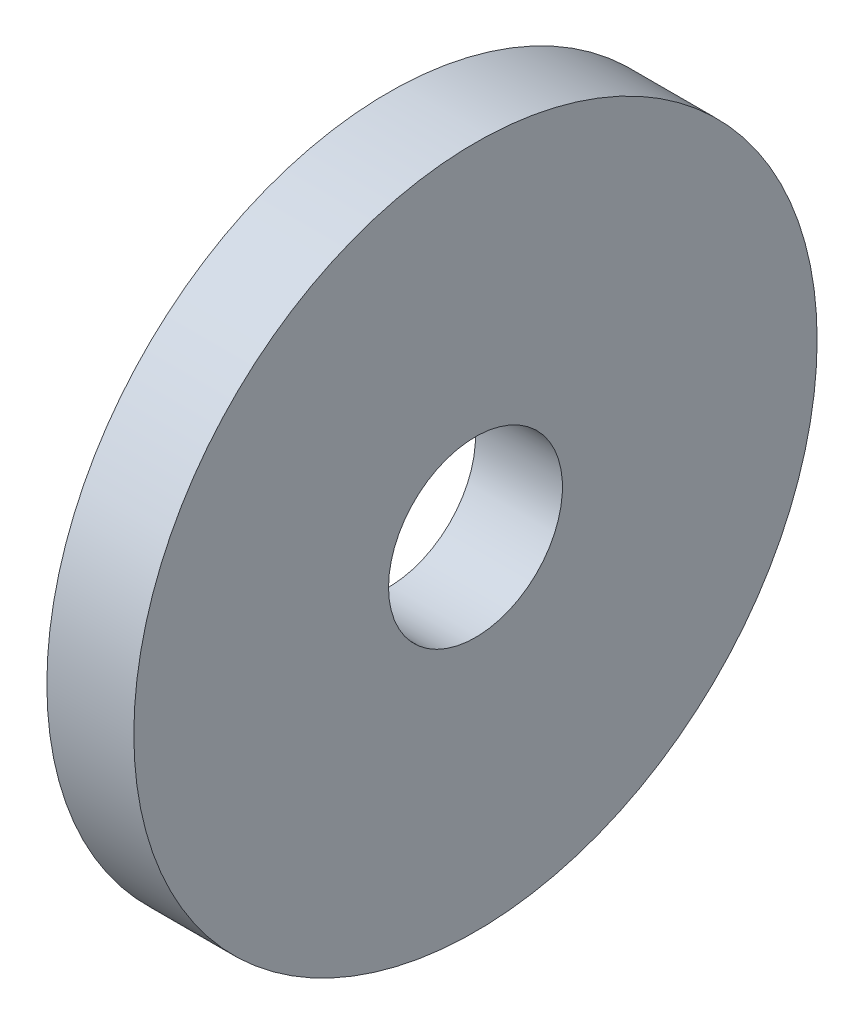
ISO-10303-21;
HEADER;
FILE_DESCRIPTION(('STEP AP214'),'2;1');
FILE_NAME('part.step','',(''),(''),'','','');
FILE_SCHEMA(('AUTOMOTIVE_DESIGN { 1 0 10303 214 1 1 1 1 }'));
ENDSEC;
DATA;
#1=APPLICATION_CONTEXT('core data for automotive mechanical design processes');
#2=APPLICATION_PROTOCOL_DEFINITION('international standard','automotive_design',2000,#1);
#3=PRODUCT_CONTEXT('',#1,'mechanical');
#4=PRODUCT('Part','Part','',(#3));
#5=PRODUCT_RELATED_PRODUCT_CATEGORY('part','',(#4));
#6=PRODUCT_DEFINITION_FORMATION('','',#4);
#7=PRODUCT_DEFINITION_CONTEXT('part definition',#1,'design');
#8=PRODUCT_DEFINITION('design','',#6,#7);
#9=PRODUCT_DEFINITION_SHAPE('','',#8);
#10=(LENGTH_UNIT() NAMED_UNIT(*) SI_UNIT(.MILLI.,.METRE.));
#11=(NAMED_UNIT(*) PLANE_ANGLE_UNIT() SI_UNIT($,.RADIAN.));
#12=(NAMED_UNIT(*) SI_UNIT($,.STERADIAN.) SOLID_ANGLE_UNIT());
#13=UNCERTAINTY_MEASURE_WITH_UNIT(LENGTH_MEASURE(1.E-05),#10,'distance_accuracy_value','');
#14=(GEOMETRIC_REPRESENTATION_CONTEXT(3) GLOBAL_UNCERTAINTY_ASSIGNED_CONTEXT((#13)) GLOBAL_UNIT_ASSIGNED_CONTEXT((#10,
#11,#12)) REPRESENTATION_CONTEXT('',''));
#15=CARTESIAN_POINT('',(0.,0.,0.));
#16=DIRECTION('',(0.,0.,1.));
#17=DIRECTION('',(1.,0.,0.));
#18=AXIS2_PLACEMENT_3D('',#15,#16,#17);
#19=CARTESIAN_POINT('',(0.,0.,-27.5));
#20=DIRECTION('',(1.,0.,0.));
#21=DIRECTION('',(0.,0.,-1.));
#22=AXIS2_PLACEMENT_3D('',#19,#20,#21);
#23=PLANE('',#22);
#24=CARTESIAN_POINT('',(0.,0.,0.));
#25=DIRECTION('',(-1.,0.,0.));
#26=DIRECTION('',(0.,0.,1.));
#27=AXIS2_PLACEMENT_3D('',#24,#25,#26);
#28=CIRCLE('',#27,7.);
#29=CARTESIAN_POINT('',(0.,0.,7.));
#30=VERTEX_POINT('',#29);
#31=EDGE_CURVE('E10',#30,#30,#28,.T.);
#32=ORIENTED_EDGE('',*,*,#31,.F.);
#33=EDGE_LOOP('',(#32));
#34=FACE_BOUND('',#33,.T.);
#35=CARTESIAN_POINT('',(0.,0.,0.));
#36=DIRECTION('',(-1.,0.,0.));
#37=DIRECTION('',(0.,0.,1.));
#38=AXIS2_PLACEMENT_3D('',#35,#36,#37);
#39=CIRCLE('',#38,27.5);
#40=CARTESIAN_POINT('',(0.,0.,27.5));
#41=VERTEX_POINT('',#40);
#42=EDGE_CURVE('E46',#41,#41,#39,.T.);
#43=ORIENTED_EDGE('',*,*,#42,.T.);
#44=EDGE_LOOP('',(#43));
#45=FACE_BOUND('',#44,.T.);
#46=ADVANCED_FACE('F32',(#34,#45),#23,.F.);
#47=CARTESIAN_POINT('',(0.,0.,0.));
#48=DIRECTION('',(-1.,0.,0.));
#49=DIRECTION('',(0.,0.,1.));
#50=AXIS2_PLACEMENT_3D('',#47,#48,#49);
#51=CYLINDRICAL_SURFACE('',#50,7.);
#52=CARTESIAN_POINT('',(7.,0.,0.));
#53=DIRECTION('',(-1.,0.,0.));
#54=DIRECTION('',(0.,0.,1.));
#55=AXIS2_PLACEMENT_3D('',#52,#53,#54);
#56=CIRCLE('',#55,7.);
#57=CARTESIAN_POINT('',(7.,0.,7.));
#58=VERTEX_POINT('',#57);
#59=EDGE_CURVE('E38',#58,#58,#56,.T.);
#60=ORIENTED_EDGE('',*,*,#59,.F.);
#61=EDGE_LOOP('',(#60));
#62=FACE_BOUND('',#61,.T.);
#63=ORIENTED_EDGE('',*,*,#31,.T.);
#64=EDGE_LOOP('',(#63));
#65=FACE_BOUND('',#64,.T.);
#66=ADVANCED_FACE('F61',(#62,#65),#51,.F.);
#67=CARTESIAN_POINT('',(7.,0.,-27.5));
#68=DIRECTION('',(-1.,0.,0.));
#69=DIRECTION('',(0.,0.,1.));
#70=AXIS2_PLACEMENT_3D('',#67,#68,#69);
#71=PLANE('',#70);
#72=CARTESIAN_POINT('',(7.,0.,0.));
#73=DIRECTION('',(-1.,0.,0.));
#74=DIRECTION('',(0.,0.,1.));
#75=AXIS2_PLACEMENT_3D('',#72,#73,#74);
#76=CIRCLE('',#75,27.5);
#77=CARTESIAN_POINT('',(7.,0.,27.5));
#78=VERTEX_POINT('',#77);
#79=EDGE_CURVE('E42',#78,#78,#76,.T.);
#80=ORIENTED_EDGE('',*,*,#79,.F.);
#81=EDGE_LOOP('',(#80));
#82=FACE_BOUND('',#81,.T.);
#83=ORIENTED_EDGE('',*,*,#59,.T.);
#84=EDGE_LOOP('',(#83));
#85=FACE_BOUND('',#84,.T.);
#86=ADVANCED_FACE('F56',(#82,#85),#71,.F.);
#87=CARTESIAN_POINT('',(0.,0.,0.));
#88=DIRECTION('',(-1.,0.,0.));
#89=DIRECTION('',(0.,0.,1.));
#90=AXIS2_PLACEMENT_3D('',#87,#88,#89);
#91=CYLINDRICAL_SURFACE('',#90,27.5);
#92=ORIENTED_EDGE('',*,*,#42,.F.);
#93=EDGE_LOOP('',(#92));
#94=FACE_BOUND('',#93,.T.);
#95=ORIENTED_EDGE('',*,*,#79,.T.);
#96=EDGE_LOOP('',(#95));
#97=FACE_BOUND('',#96,.T.);
#98=ADVANCED_FACE('F53',(#94,#97),#91,.T.);
#99=CLOSED_SHELL('',(#46,#66,#86,#98));
#100=MANIFOLD_SOLID_BREP('B2',#99);
#101=ADVANCED_BREP_SHAPE_REPRESENTATION('',(#18,#100),#14);
#102=SHAPE_DEFINITION_REPRESENTATION(#9,#101);
ENDSEC;
END-ISO-10303-21;
